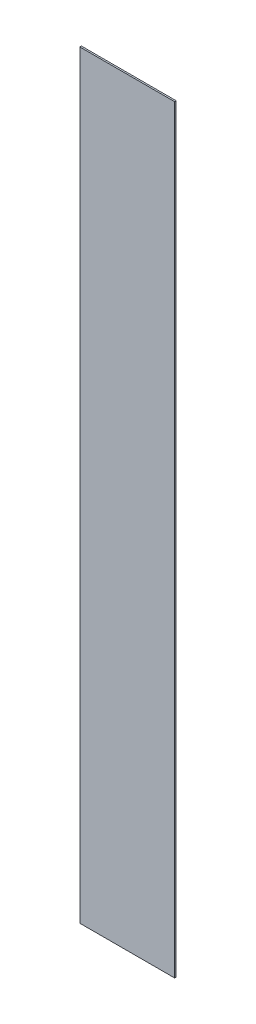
from build123d import *

# Parameters (mm, degrees)
EW_SKETCH_W      = 60
EW_SKETCH_H      = 1
EW_EXTRUDE_DEPTH = 480


with BuildPart() as part:
    # EW_SKETCH → EW_EXTRUDE (new body)
    with BuildSketch(Plane(origin=(0, 0, 0), x_dir=(1, 0, 0), z_dir=(0, 1, 0))):
        with Locations((0, -0.5)):
            Rectangle(EW_SKETCH_W, EW_SKETCH_H)
    extrude(amount=EW_EXTRUDE_DEPTH)


solid = part.part
